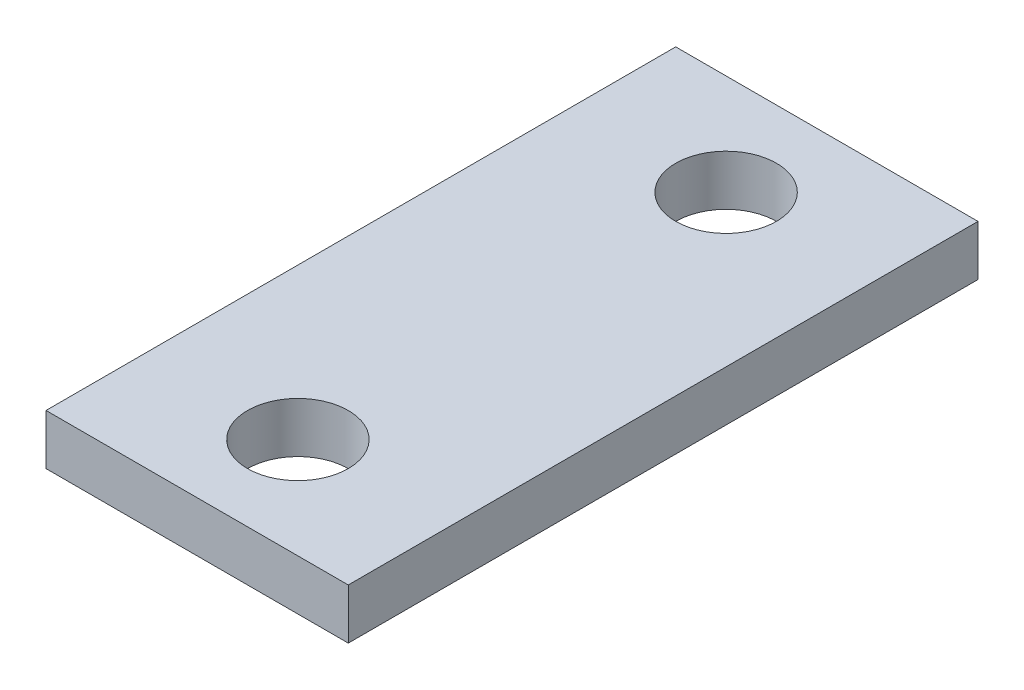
from build123d import *

# Parameters (mm, degrees)
SKETCH1_W           = 12
SKETCH1_H           = 25
SKETCH1_R           = 2
BOSS_EXTRUDE1_DEPTH = 2


with BuildPart() as part:
    # Sketch1 → Boss-Extrude1 (new body)
    with BuildSketch(Plane(origin=(0, 0, 0), x_dir=(1, 0, 0), z_dir=(0, 1, 0))):
        with Locations((6, 12.5)):
            Rectangle(SKETCH1_W, SKETCH1_H)
        with Locations(Location((6, 21, 0), (0, 0, 270))):
            Circle(SKETCH1_R, mode=Mode.SUBTRACT)
        with Locations(Location((6, 4, 0), (0, 0, 270))):
            Circle(SKETCH1_R, mode=Mode.SUBTRACT)
    extrude(amount=BOSS_EXTRUDE1_DEPTH)


solid = part.part
